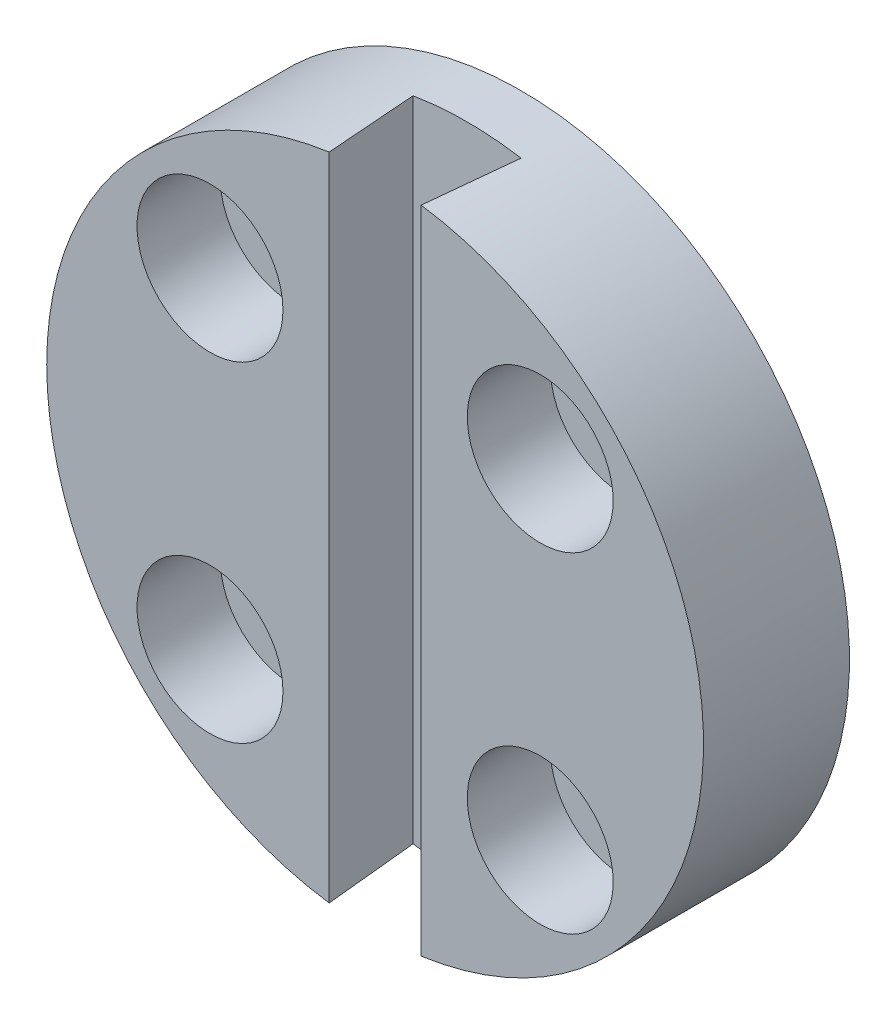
ISO-10303-21;
HEADER;
FILE_DESCRIPTION(('STEP AP214'),'2;1');
FILE_NAME('part.step','',(''),(''),'','','');
FILE_SCHEMA(('AUTOMOTIVE_DESIGN { 1 0 10303 214 1 1 1 1 }'));
ENDSEC;
DATA;
#1=APPLICATION_CONTEXT('core data for automotive mechanical design processes');
#2=APPLICATION_PROTOCOL_DEFINITION('international standard','automotive_design',2000,#1);
#3=PRODUCT_CONTEXT('',#1,'mechanical');
#4=PRODUCT('Part','Part','',(#3));
#5=PRODUCT_RELATED_PRODUCT_CATEGORY('part','',(#4));
#6=PRODUCT_DEFINITION_FORMATION('','',#4);
#7=PRODUCT_DEFINITION_CONTEXT('part definition',#1,'design');
#8=PRODUCT_DEFINITION('design','',#6,#7);
#9=PRODUCT_DEFINITION_SHAPE('','',#8);
#10=(LENGTH_UNIT() NAMED_UNIT(*) SI_UNIT(.MILLI.,.METRE.));
#11=(NAMED_UNIT(*) PLANE_ANGLE_UNIT() SI_UNIT($,.RADIAN.));
#12=(NAMED_UNIT(*) SI_UNIT($,.STERADIAN.) SOLID_ANGLE_UNIT());
#13=UNCERTAINTY_MEASURE_WITH_UNIT(LENGTH_MEASURE(1.E-05),#10,'distance_accuracy_value','');
#14=(GEOMETRIC_REPRESENTATION_CONTEXT(3) GLOBAL_UNCERTAINTY_ASSIGNED_CONTEXT((#13)) GLOBAL_UNIT_ASSIGNED_CONTEXT((#10,
#11,#12)) REPRESENTATION_CONTEXT('',''));
#15=CARTESIAN_POINT('',(0.,0.,0.));
#16=DIRECTION('',(0.,0.,1.));
#17=DIRECTION('',(1.,0.,0.));
#18=AXIS2_PLACEMENT_3D('',#15,#16,#17);
#19=CARTESIAN_POINT('',(11.3137084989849,11.3137084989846,10.));
#20=DIRECTION('',(0.,0.,1.));
#21=DIRECTION('',(1.,0.,0.));
#22=AXIS2_PLACEMENT_3D('',#19,#20,#21);
#23=CYLINDRICAL_SURFACE('',#22,4.99999999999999);
#24=CARTESIAN_POINT('',(11.3137084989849,11.3137084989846,10.));
#25=DIRECTION('',(0.,0.,1.));
#26=DIRECTION('',(1.,0.,0.));
#27=AXIS2_PLACEMENT_3D('',#24,#25,#26);
#28=CIRCLE('',#27,4.99999999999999);
#29=CARTESIAN_POINT('',(16.3137084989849,11.3137084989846,10.));
#30=VERTEX_POINT('',#29);
#31=EDGE_CURVE('E108',#30,#30,#28,.F.);
#32=ORIENTED_EDGE('',*,*,#31,.F.);
#33=EDGE_LOOP('',(#32));
#34=FACE_BOUND('',#33,.T.);
#35=CARTESIAN_POINT('',(11.3137084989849,11.3137084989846,4.3));
#36=DIRECTION('',(0.,0.,1.));
#37=DIRECTION('',(1.,0.,0.));
#38=AXIS2_PLACEMENT_3D('',#35,#36,#37);
#39=CIRCLE('',#38,4.99999999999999);
#40=CARTESIAN_POINT('',(16.3137084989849,11.3137084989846,4.3));
#41=VERTEX_POINT('',#40);
#42=EDGE_CURVE('E20',#41,#41,#39,.F.);
#43=ORIENTED_EDGE('',*,*,#42,.T.);
#44=EDGE_LOOP('',(#43));
#45=FACE_BOUND('',#44,.T.);
#46=ADVANCED_FACE('F17',(#34,#45),#23,.F.);
#47=CARTESIAN_POINT('',(11.3137084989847,-11.3137084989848,10.));
#48=DIRECTION('',(0.,0.,1.));
#49=DIRECTION('',(1.,0.,0.));
#50=AXIS2_PLACEMENT_3D('',#47,#48,#49);
#51=CYLINDRICAL_SURFACE('',#50,4.99999999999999);
#52=CARTESIAN_POINT('',(11.3137084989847,-11.3137084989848,10.));
#53=DIRECTION('',(0.,0.,1.));
#54=DIRECTION('',(1.,0.,0.));
#55=AXIS2_PLACEMENT_3D('',#52,#53,#54);
#56=CIRCLE('',#55,4.99999999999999);
#57=CARTESIAN_POINT('',(16.3137084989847,-11.3137084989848,10.));
#58=VERTEX_POINT('',#57);
#59=EDGE_CURVE('E73',#58,#58,#56,.F.);
#60=ORIENTED_EDGE('',*,*,#59,.F.);
#61=EDGE_LOOP('',(#60));
#62=FACE_BOUND('',#61,.T.);
#63=CARTESIAN_POINT('',(11.3137084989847,-11.3137084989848,4.3));
#64=DIRECTION('',(0.,0.,1.));
#65=DIRECTION('',(1.,0.,0.));
#66=AXIS2_PLACEMENT_3D('',#63,#64,#65);
#67=CIRCLE('',#66,4.99999999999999);
#68=CARTESIAN_POINT('',(16.3137084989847,-11.3137084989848,4.3));
#69=VERTEX_POINT('',#68);
#70=EDGE_CURVE('E111',#69,#69,#67,.F.);
#71=ORIENTED_EDGE('',*,*,#70,.T.);
#72=EDGE_LOOP('',(#71));
#73=FACE_BOUND('',#72,.T.);
#74=ADVANCED_FACE('F196',(#62,#73),#51,.F.);
#75=CARTESIAN_POINT('',(-11.3137084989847,11.3137084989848,10.));
#76=DIRECTION('',(0.,0.,1.));
#77=DIRECTION('',(1.,0.,0.));
#78=AXIS2_PLACEMENT_3D('',#75,#76,#77);
#79=CYLINDRICAL_SURFACE('',#78,4.99999999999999);
#80=CARTESIAN_POINT('',(-11.3137084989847,11.3137084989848,10.));
#81=DIRECTION('',(0.,0.,1.));
#82=DIRECTION('',(1.,0.,0.));
#83=AXIS2_PLACEMENT_3D('',#80,#81,#82);
#84=CIRCLE('',#83,4.99999999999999);
#85=CARTESIAN_POINT('',(-6.31370849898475,11.3137084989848,10.));
#86=VERTEX_POINT('',#85);
#87=EDGE_CURVE('E102',#86,#86,#84,.F.);
#88=ORIENTED_EDGE('',*,*,#87,.F.);
#89=EDGE_LOOP('',(#88));
#90=FACE_BOUND('',#89,.T.);
#91=CARTESIAN_POINT('',(-11.3137084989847,11.3137084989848,4.3));
#92=DIRECTION('',(0.,0.,1.));
#93=DIRECTION('',(1.,0.,0.));
#94=AXIS2_PLACEMENT_3D('',#91,#92,#93);
#95=CIRCLE('',#94,4.99999999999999);
#96=CARTESIAN_POINT('',(-6.31370849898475,11.3137084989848,4.3));
#97=VERTEX_POINT('',#96);
#98=EDGE_CURVE('E116',#97,#97,#95,.F.);
#99=ORIENTED_EDGE('',*,*,#98,.T.);
#100=EDGE_LOOP('',(#99));
#101=FACE_BOUND('',#100,.T.);
#102=ADVANCED_FACE('F193',(#90,#101),#79,.F.);
#103=CARTESIAN_POINT('',(-11.3137084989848,-11.3137084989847,10.));
#104=DIRECTION('',(0.,0.,1.));
#105=DIRECTION('',(1.,0.,0.));
#106=AXIS2_PLACEMENT_3D('',#103,#104,#105);
#107=CYLINDRICAL_SURFACE('',#106,4.99999999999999);
#108=CARTESIAN_POINT('',(-11.3137084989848,-11.3137084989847,10.));
#109=DIRECTION('',(0.,0.,1.));
#110=DIRECTION('',(1.,0.,0.));
#111=AXIS2_PLACEMENT_3D('',#108,#109,#110);
#112=CIRCLE('',#111,4.99999999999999);
#113=CARTESIAN_POINT('',(-6.31370849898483,-11.3137084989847,10.));
#114=VERTEX_POINT('',#113);
#115=EDGE_CURVE('E99',#114,#114,#112,.F.);
#116=ORIENTED_EDGE('',*,*,#115,.F.);
#117=EDGE_LOOP('',(#116));
#118=FACE_BOUND('',#117,.T.);
#119=CARTESIAN_POINT('',(-11.3137084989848,-11.3137084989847,4.3));
#120=DIRECTION('',(0.,0.,1.));
#121=DIRECTION('',(1.,0.,0.));
#122=AXIS2_PLACEMENT_3D('',#119,#120,#121);
#123=CIRCLE('',#122,4.99999999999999);
#124=CARTESIAN_POINT('',(-6.31370849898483,-11.3137084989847,4.3));
#125=VERTEX_POINT('',#124);
#126=EDGE_CURVE('E114',#125,#125,#123,.F.);
#127=ORIENTED_EDGE('',*,*,#126,.T.);
#128=EDGE_LOOP('',(#127));
#129=FACE_BOUND('',#128,.T.);
#130=ADVANCED_FACE('F128',(#118,#129),#107,.F.);
#131=CARTESIAN_POINT('',(13.9637084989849,11.3137084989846,4.3));
#132=DIRECTION('',(0.,0.,-1.));
#133=DIRECTION('',(-1.,0.,0.));
#134=AXIS2_PLACEMENT_3D('',#131,#132,#133);
#135=PLANE('',#134);
#136=ORIENTED_EDGE('',*,*,#42,.F.);
#137=EDGE_LOOP('',(#136));
#138=FACE_BOUND('',#137,.T.);
#139=CARTESIAN_POINT('',(11.3137084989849,11.3137084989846,4.3));
#140=DIRECTION('',(0.,0.,1.));
#141=DIRECTION('',(1.,0.,0.));
#142=AXIS2_PLACEMENT_3D('',#139,#140,#141);
#143=CIRCLE('',#142,2.65);
#144=CARTESIAN_POINT('',(13.9637084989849,11.3137084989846,4.3));
#145=VERTEX_POINT('',#144);
#146=EDGE_CURVE('E95',#145,#145,#143,.F.);
#147=ORIENTED_EDGE('',*,*,#146,.T.);
#148=EDGE_LOOP('',(#147));
#149=FACE_BOUND('',#148,.T.);
#150=ADVANCED_FACE('F124',(#138,#149),#135,.F.);
#151=CARTESIAN_POINT('',(-8.66370849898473,11.3137084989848,4.3));
#152=DIRECTION('',(0.,0.,-1.));
#153=DIRECTION('',(-1.,0.,0.));
#154=AXIS2_PLACEMENT_3D('',#151,#152,#153);
#155=PLANE('',#154);
#156=ORIENTED_EDGE('',*,*,#98,.F.);
#157=EDGE_LOOP('',(#156));
#158=FACE_BOUND('',#157,.T.);
#159=CARTESIAN_POINT('',(-11.3137084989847,11.3137084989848,4.3));
#160=DIRECTION('',(0.,0.,1.));
#161=DIRECTION('',(1.,0.,0.));
#162=AXIS2_PLACEMENT_3D('',#159,#160,#161);
#163=CIRCLE('',#162,2.65);
#164=CARTESIAN_POINT('',(-8.66370849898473,11.3137084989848,4.3));
#165=VERTEX_POINT('',#164);
#166=EDGE_CURVE('E92',#165,#165,#163,.F.);
#167=ORIENTED_EDGE('',*,*,#166,.T.);
#168=EDGE_LOOP('',(#167));
#169=FACE_BOUND('',#168,.T.);
#170=ADVANCED_FACE('F127',(#158,#169),#155,.F.);
#171=CARTESIAN_POINT('',(-8.66370849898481,-11.3137084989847,4.3));
#172=DIRECTION('',(0.,0.,-1.));
#173=DIRECTION('',(-1.,0.,0.));
#174=AXIS2_PLACEMENT_3D('',#171,#172,#173);
#175=PLANE('',#174);
#176=ORIENTED_EDGE('',*,*,#126,.F.);
#177=EDGE_LOOP('',(#176));
#178=FACE_BOUND('',#177,.T.);
#179=CARTESIAN_POINT('',(-11.3137084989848,-11.3137084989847,4.3));
#180=DIRECTION('',(0.,0.,1.));
#181=DIRECTION('',(1.,0.,0.));
#182=AXIS2_PLACEMENT_3D('',#179,#180,#181);
#183=CIRCLE('',#182,2.65);
#184=CARTESIAN_POINT('',(-8.66370849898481,-11.3137084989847,4.3));
#185=VERTEX_POINT('',#184);
#186=EDGE_CURVE('E89',#185,#185,#183,.F.);
#187=ORIENTED_EDGE('',*,*,#186,.T.);
#188=EDGE_LOOP('',(#187));
#189=FACE_BOUND('',#188,.T.);
#190=ADVANCED_FACE('F175',(#178,#189),#175,.F.);
#191=CARTESIAN_POINT('',(13.9637084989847,-11.3137084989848,4.3));
#192=DIRECTION('',(0.,0.,-1.));
#193=DIRECTION('',(-1.,0.,0.));
#194=AXIS2_PLACEMENT_3D('',#191,#192,#193);
#195=PLANE('',#194);
#196=ORIENTED_EDGE('',*,*,#70,.F.);
#197=EDGE_LOOP('',(#196));
#198=FACE_BOUND('',#197,.T.);
#199=CARTESIAN_POINT('',(11.3137084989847,-11.3137084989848,4.3));
#200=DIRECTION('',(0.,0.,1.));
#201=DIRECTION('',(1.,0.,0.));
#202=AXIS2_PLACEMENT_3D('',#199,#200,#201);
#203=CIRCLE('',#202,2.65);
#204=CARTESIAN_POINT('',(13.9637084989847,-11.3137084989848,4.3));
#205=VERTEX_POINT('',#204);
#206=EDGE_CURVE('E86',#205,#205,#203,.F.);
#207=ORIENTED_EDGE('',*,*,#206,.T.);
#208=EDGE_LOOP('',(#207));
#209=FACE_BOUND('',#208,.T.);
#210=ADVANCED_FACE('F177',(#198,#209),#195,.F.);
#211=CARTESIAN_POINT('',(0.,0.,10.));
#212=DIRECTION('',(0.,0.,1.));
#213=DIRECTION('',(1.,0.,0.));
#214=AXIS2_PLACEMENT_3D('',#211,#212,#213);
#215=PLANE('',#214);
#216=CARTESIAN_POINT('',(0.,0.,10.));
#217=DIRECTION('',(0.,0.,-1.));
#218=DIRECTION('',(-1.,0.,0.));
#219=AXIS2_PLACEMENT_3D('',#216,#217,#218);
#220=CIRCLE('',#219,22.5);
#221=CARTESIAN_POINT('',(3.15,22.2784088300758,10.));
#222=VERTEX_POINT('',#221);
#223=CARTESIAN_POINT('',(3.15,-22.2784088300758,10.));
#224=VERTEX_POINT('',#223);
#225=EDGE_CURVE('E58',#222,#224,#220,.T.);
#226=ORIENTED_EDGE('',*,*,#225,.F.);
#227=DIRECTION('',(0.,1.,0.));
#228=VECTOR('',#227,1.);
#229=CARTESIAN_POINT('',(3.15,-22.5,10.));
#230=LINE('',#229,#228);
#231=EDGE_CURVE('E62',#222,#224,#230,.F.);
#232=ORIENTED_EDGE('',*,*,#231,.T.);
#233=EDGE_LOOP('',(#226,#232));
#234=FACE_BOUND('',#233,.T.);
#235=ORIENTED_EDGE('',*,*,#59,.T.);
#236=EDGE_LOOP('',(#235));
#237=FACE_BOUND('',#236,.T.);
#238=ORIENTED_EDGE('',*,*,#31,.T.);
#239=EDGE_LOOP('',(#238));
#240=FACE_BOUND('',#239,.T.);
#241=ADVANCED_FACE('F60',(#234,#237,#240),#215,.T.);
#242=CARTESIAN_POINT('',(3.15,-22.5,10.));
#243=DIRECTION('',(0.996194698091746,0.,0.0871557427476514));
#244=DIRECTION('',(0.0871557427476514,0.,-0.996194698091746));
#245=AXIS2_PLACEMENT_3D('',#242,#243,#244);
#246=PLANE('',#245);
#247=CARTESIAN_POINT('',(0.,0.,46.004664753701));
#248=DIRECTION('',(0.996194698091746,0.,0.0871557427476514));
#249=DIRECTION('',(0.0871557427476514,0.,-0.996194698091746));
#250=AXIS2_PLACEMENT_3D('',#247,#248,#249);
#251=ELLIPSE('',#250,258.158548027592,22.5);
#252=CARTESIAN_POINT('',(3.70117858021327,-22.193496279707,3.7));
#253=VERTEX_POINT('',#252);
#254=EDGE_CURVE('E65',#224,#253,#251,.T.);
#255=ORIENTED_EDGE('',*,*,#254,.F.);
#256=ORIENTED_EDGE('',*,*,#231,.F.);
#257=CARTESIAN_POINT('',(0.,0.,46.004664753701));
#258=DIRECTION('',(0.996194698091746,0.,0.0871557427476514));
#259=DIRECTION('',(0.0871557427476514,0.,-0.996194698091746));
#260=AXIS2_PLACEMENT_3D('',#257,#258,#259);
#261=ELLIPSE('',#260,258.158548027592,22.5);
#262=CARTESIAN_POINT('',(3.70117858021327,22.193496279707,3.7));
#263=VERTEX_POINT('',#262);
#264=EDGE_CURVE('E66',#263,#222,#261,.T.);
#265=ORIENTED_EDGE('',*,*,#264,.F.);
#266=DIRECTION('',(0.,1.,0.));
#267=VECTOR('',#266,1.);
#268=CARTESIAN_POINT('',(3.70117858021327,0.,3.7));
#269=LINE('',#268,#267);
#270=EDGE_CURVE('E72',#253,#263,#269,.T.);
#271=ORIENTED_EDGE('',*,*,#270,.F.);
#272=EDGE_LOOP('',(#255,#256,#265,#271));
#273=FACE_BOUND('',#272,.T.);
#274=ADVANCED_FACE('F70',(#273),#246,.F.);
#275=CARTESIAN_POINT('',(0.,0.,3.7));
#276=DIRECTION('',(0.,0.,1.));
#277=DIRECTION('',(1.,0.,0.));
#278=AXIS2_PLACEMENT_3D('',#275,#276,#277);
#279=PLANE('',#278);
#280=CARTESIAN_POINT('',(0.,0.,3.70000000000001));
#281=DIRECTION('',(0.,0.,-1.));
#282=DIRECTION('',(-1.,0.,0.));
#283=AXIS2_PLACEMENT_3D('',#280,#281,#282);
#284=CIRCLE('',#283,22.5);
#285=CARTESIAN_POINT('',(-3.70117858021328,-22.193496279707,3.7));
#286=VERTEX_POINT('',#285);
#287=EDGE_CURVE('E229',#253,#286,#284,.T.);
#288=ORIENTED_EDGE('',*,*,#287,.F.);
#289=ORIENTED_EDGE('',*,*,#270,.T.);
#290=CARTESIAN_POINT('',(0.,0.,3.7));
#291=DIRECTION('',(0.,0.,-1.));
#292=DIRECTION('',(-1.,0.,0.));
#293=AXIS2_PLACEMENT_3D('',#290,#291,#292);
#294=CIRCLE('',#293,22.5);
#295=CARTESIAN_POINT('',(-3.70117858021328,22.193496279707,3.7));
#296=VERTEX_POINT('',#295);
#297=EDGE_CURVE('E79',#296,#263,#294,.T.);
#298=ORIENTED_EDGE('',*,*,#297,.F.);
#299=DIRECTION('',(0.,1.,0.));
#300=VECTOR('',#299,1.);
#301=CARTESIAN_POINT('',(-3.70117858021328,-22.5,3.7));
#302=LINE('',#301,#300);
#303=EDGE_CURVE('E105',#296,#286,#302,.F.);
#304=ORIENTED_EDGE('',*,*,#303,.T.);
#305=EDGE_LOOP('',(#288,#289,#298,#304));
#306=FACE_BOUND('',#305,.T.);
#307=ADVANCED_FACE('F216',(#306),#279,.T.);
#308=CARTESIAN_POINT('',(-3.70117858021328,-22.5,3.7));
#309=DIRECTION('',(-0.996194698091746,0.,0.0871557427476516));
#310=DIRECTION('',(0.0871557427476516,0.,0.996194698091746));
#311=AXIS2_PLACEMENT_3D('',#308,#309,#310);
#312=PLANE('',#311);
#313=CARTESIAN_POINT('',(0.,0.,46.004664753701));
#314=DIRECTION('',(-0.996194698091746,0.,0.0871557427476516));
#315=DIRECTION('',(-0.0871557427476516,0.,-0.996194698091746));
#316=AXIS2_PLACEMENT_3D('',#313,#314,#315);
#317=ELLIPSE('',#316,258.158548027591,22.5);
#318=CARTESIAN_POINT('',(-3.15,22.2784088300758,10.));
#319=VERTEX_POINT('',#318);
#320=EDGE_CURVE('E81',#319,#296,#317,.T.);
#321=ORIENTED_EDGE('',*,*,#320,.F.);
#322=DIRECTION('',(0.,1.,0.));
#323=VECTOR('',#322,1.);
#324=CARTESIAN_POINT('',(-3.15,0.,10.));
#325=LINE('',#324,#323);
#326=CARTESIAN_POINT('',(-3.15,-22.2784088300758,10.));
#327=VERTEX_POINT('',#326);
#328=EDGE_CURVE('E98',#327,#319,#325,.T.);
#329=ORIENTED_EDGE('',*,*,#328,.F.);
#330=CARTESIAN_POINT('',(0.,0.,46.004664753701));
#331=DIRECTION('',(-0.996194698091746,0.,0.0871557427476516));
#332=DIRECTION('',(-0.0871557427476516,0.,-0.996194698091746));
#333=AXIS2_PLACEMENT_3D('',#330,#331,#332);
#334=ELLIPSE('',#333,258.158548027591,22.5);
#335=EDGE_CURVE('E35',#286,#327,#334,.T.);
#336=ORIENTED_EDGE('',*,*,#335,.F.);
#337=ORIENTED_EDGE('',*,*,#303,.F.);
#338=EDGE_LOOP('',(#321,#329,#336,#337));
#339=FACE_BOUND('',#338,.T.);
#340=ADVANCED_FACE('F146',(#339),#312,.F.);
#341=CARTESIAN_POINT('',(0.,0.,10.));
#342=DIRECTION('',(0.,0.,1.));
#343=DIRECTION('',(1.,0.,0.));
#344=AXIS2_PLACEMENT_3D('',#341,#342,#343);
#345=PLANE('',#344);
#346=ORIENTED_EDGE('',*,*,#328,.T.);
#347=CARTESIAN_POINT('',(0.,0.,10.));
#348=DIRECTION('',(0.,0.,-1.));
#349=DIRECTION('',(-1.,0.,0.));
#350=AXIS2_PLACEMENT_3D('',#347,#348,#349);
#351=CIRCLE('',#350,22.5);
#352=EDGE_CURVE('E53',#327,#319,#351,.T.);
#353=ORIENTED_EDGE('',*,*,#352,.F.);
#354=EDGE_LOOP('',(#346,#353));
#355=FACE_BOUND('',#354,.T.);
#356=ORIENTED_EDGE('',*,*,#115,.T.);
#357=EDGE_LOOP('',(#356));
#358=FACE_BOUND('',#357,.T.);
#359=ORIENTED_EDGE('',*,*,#87,.T.);
#360=EDGE_LOOP('',(#359));
#361=FACE_BOUND('',#360,.T.);
#362=ADVANCED_FACE('F135',(#355,#358,#361),#345,.T.);
#363=CARTESIAN_POINT('',(11.3137084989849,11.3137084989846,10.));
#364=DIRECTION('',(0.,0.,1.));
#365=DIRECTION('',(1.,0.,0.));
#366=AXIS2_PLACEMENT_3D('',#363,#364,#365);
#367=CYLINDRICAL_SURFACE('',#366,2.65);
#368=CARTESIAN_POINT('',(11.3137084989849,11.3137084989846,0.));
#369=DIRECTION('',(0.,0.,1.));
#370=DIRECTION('',(1.,0.,0.));
#371=AXIS2_PLACEMENT_3D('',#368,#369,#370);
#372=CIRCLE('',#371,2.65);
#373=CARTESIAN_POINT('',(13.9637084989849,11.3137084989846,0.));
#374=VERTEX_POINT('',#373);
#375=EDGE_CURVE('E240',#374,#374,#372,.F.);
#376=ORIENTED_EDGE('',*,*,#375,.T.);
#377=EDGE_LOOP('',(#376));
#378=FACE_BOUND('',#377,.T.);
#379=ORIENTED_EDGE('',*,*,#146,.F.);
#380=EDGE_LOOP('',(#379));
#381=FACE_BOUND('',#380,.T.);
#382=ADVANCED_FACE('F132',(#378,#381),#367,.F.);
#383=CARTESIAN_POINT('',(-11.3137084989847,11.3137084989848,10.));
#384=DIRECTION('',(0.,0.,1.));
#385=DIRECTION('',(1.,0.,0.));
#386=AXIS2_PLACEMENT_3D('',#383,#384,#385);
#387=CYLINDRICAL_SURFACE('',#386,2.65);
#388=CARTESIAN_POINT('',(-11.3137084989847,11.3137084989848,0.));
#389=DIRECTION('',(0.,0.,1.));
#390=DIRECTION('',(1.,0.,0.));
#391=AXIS2_PLACEMENT_3D('',#388,#389,#390);
#392=CIRCLE('',#391,2.65);
#393=CARTESIAN_POINT('',(-8.66370849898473,11.3137084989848,0.));
#394=VERTEX_POINT('',#393);
#395=EDGE_CURVE('E237',#394,#394,#392,.F.);
#396=ORIENTED_EDGE('',*,*,#395,.T.);
#397=EDGE_LOOP('',(#396));
#398=FACE_BOUND('',#397,.T.);
#399=ORIENTED_EDGE('',*,*,#166,.F.);
#400=EDGE_LOOP('',(#399));
#401=FACE_BOUND('',#400,.T.);
#402=ADVANCED_FACE('F134',(#398,#401),#387,.F.);
#403=CARTESIAN_POINT('',(-11.3137084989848,-11.3137084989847,10.));
#404=DIRECTION('',(0.,0.,1.));
#405=DIRECTION('',(1.,0.,0.));
#406=AXIS2_PLACEMENT_3D('',#403,#404,#405);
#407=CYLINDRICAL_SURFACE('',#406,2.65);
#408=CARTESIAN_POINT('',(-11.3137084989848,-11.3137084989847,0.));
#409=DIRECTION('',(0.,0.,1.));
#410=DIRECTION('',(1.,0.,0.));
#411=AXIS2_PLACEMENT_3D('',#408,#409,#410);
#412=CIRCLE('',#411,2.65);
#413=CARTESIAN_POINT('',(-8.66370849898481,-11.3137084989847,0.));
#414=VERTEX_POINT('',#413);
#415=EDGE_CURVE('E172',#414,#414,#412,.F.);
#416=ORIENTED_EDGE('',*,*,#415,.T.);
#417=EDGE_LOOP('',(#416));
#418=FACE_BOUND('',#417,.T.);
#419=ORIENTED_EDGE('',*,*,#186,.F.);
#420=EDGE_LOOP('',(#419));
#421=FACE_BOUND('',#420,.T.);
#422=ADVANCED_FACE('F143',(#418,#421),#407,.F.);
#423=CARTESIAN_POINT('',(11.3137084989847,-11.3137084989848,10.));
#424=DIRECTION('',(0.,0.,1.));
#425=DIRECTION('',(1.,0.,0.));
#426=AXIS2_PLACEMENT_3D('',#423,#424,#425);
#427=CYLINDRICAL_SURFACE('',#426,2.65);
#428=CARTESIAN_POINT('',(11.3137084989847,-11.3137084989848,0.));
#429=DIRECTION('',(0.,0.,1.));
#430=DIRECTION('',(1.,0.,0.));
#431=AXIS2_PLACEMENT_3D('',#428,#429,#430);
#432=CIRCLE('',#431,2.65);
#433=CARTESIAN_POINT('',(13.9637084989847,-11.3137084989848,0.));
#434=VERTEX_POINT('',#433);
#435=EDGE_CURVE('E26',#434,#434,#432,.F.);
#436=ORIENTED_EDGE('',*,*,#435,.T.);
#437=EDGE_LOOP('',(#436));
#438=FACE_BOUND('',#437,.T.);
#439=ORIENTED_EDGE('',*,*,#206,.F.);
#440=EDGE_LOOP('',(#439));
#441=FACE_BOUND('',#440,.T.);
#442=ADVANCED_FACE('F157',(#438,#441),#427,.F.);
#443=CARTESIAN_POINT('',(0.,0.,10.));
#444=DIRECTION('',(0.,0.,-1.));
#445=DIRECTION('',(-1.,0.,0.));
#446=AXIS2_PLACEMENT_3D('',#443,#444,#445);
#447=CYLINDRICAL_SURFACE('',#446,22.5);
#448=ORIENTED_EDGE('',*,*,#264,.T.);
#449=ORIENTED_EDGE('',*,*,#225,.T.);
#450=ORIENTED_EDGE('',*,*,#254,.T.);
#451=ORIENTED_EDGE('',*,*,#287,.T.);
#452=ORIENTED_EDGE('',*,*,#335,.T.);
#453=ORIENTED_EDGE('',*,*,#352,.T.);
#454=ORIENTED_EDGE('',*,*,#320,.T.);
#455=ORIENTED_EDGE('',*,*,#297,.T.);
#456=EDGE_LOOP('',(#448,#449,#450,#451,#452,#453,#454,#455));
#457=FACE_BOUND('',#456,.T.);
#458=CARTESIAN_POINT('',(0.,0.,0.));
#459=DIRECTION('',(0.,0.,-1.));
#460=DIRECTION('',(-1.,0.,0.));
#461=AXIS2_PLACEMENT_3D('',#458,#459,#460);
#462=CIRCLE('',#461,22.5);
#463=CARTESIAN_POINT('',(-22.5,0.,0.));
#464=VERTEX_POINT('',#463);
#465=EDGE_CURVE('E11',#464,#464,#462,.F.);
#466=ORIENTED_EDGE('',*,*,#465,.T.);
#467=EDGE_LOOP('',(#466));
#468=FACE_BOUND('',#467,.T.);
#469=ADVANCED_FACE('F76',(#457,#468),#447,.T.);
#470=CARTESIAN_POINT('',(0.,0.,0.));
#471=DIRECTION('',(0.,0.,1.));
#472=DIRECTION('',(1.,0.,0.));
#473=AXIS2_PLACEMENT_3D('',#470,#471,#472);
#474=PLANE('',#473);
#475=ORIENTED_EDGE('',*,*,#465,.F.);
#476=EDGE_LOOP('',(#475));
#477=FACE_BOUND('',#476,.T.);
#478=ORIENTED_EDGE('',*,*,#435,.F.);
#479=EDGE_LOOP('',(#478));
#480=FACE_BOUND('',#479,.T.);
#481=ORIENTED_EDGE('',*,*,#415,.F.);
#482=EDGE_LOOP('',(#481));
#483=FACE_BOUND('',#482,.T.);
#484=ORIENTED_EDGE('',*,*,#395,.F.);
#485=EDGE_LOOP('',(#484));
#486=FACE_BOUND('',#485,.T.);
#487=ORIENTED_EDGE('',*,*,#375,.F.);
#488=EDGE_LOOP('',(#487));
#489=FACE_BOUND('',#488,.T.);
#490=ADVANCED_FACE('F150',(#477,#480,#483,#486,#489),#474,.F.);
#491=CLOSED_SHELL('',(#46,#74,#102,#130,#150,#170,#190,#210,#241,#274,#307,#340,#362,#382,#402,
#422,#442,#469,#490));
#492=MANIFOLD_SOLID_BREP('B1',#491);
#493=ADVANCED_BREP_SHAPE_REPRESENTATION('',(#18,#492),#14);
#494=SHAPE_DEFINITION_REPRESENTATION(#9,#493);
ENDSEC;
END-ISO-10303-21;
